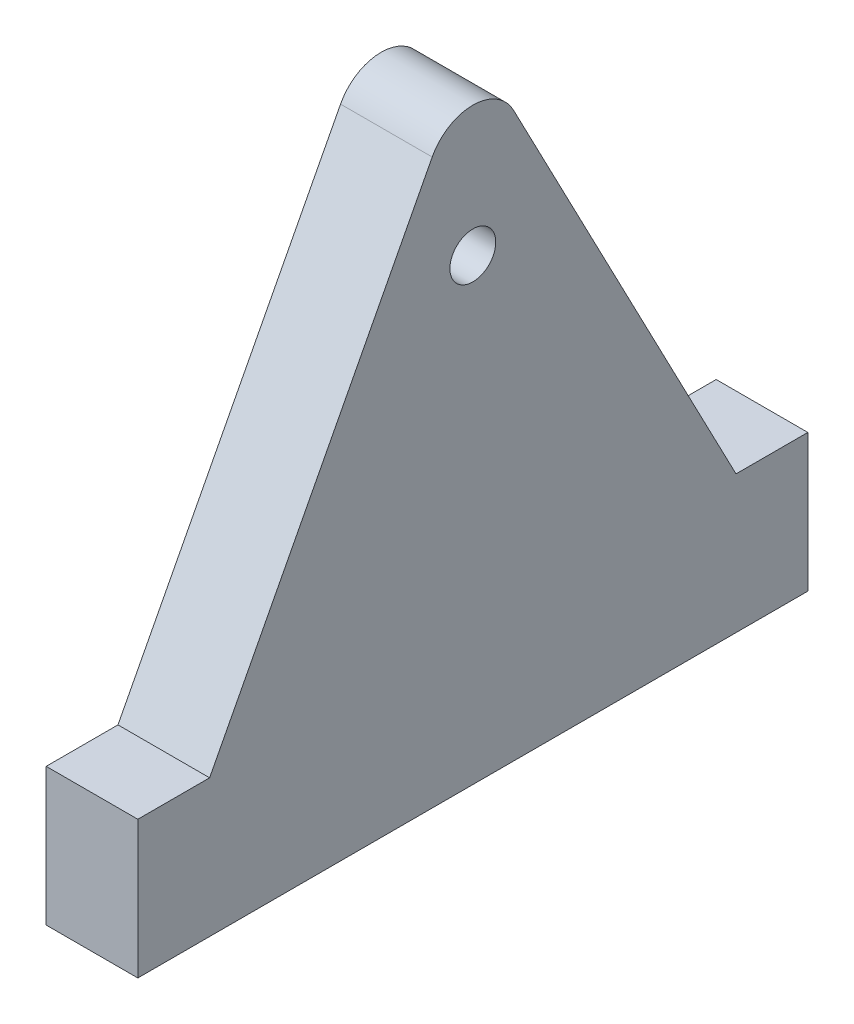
from build123d import *

# Parameters (mm, degrees)
BOSS_EXTRUDE1_DEPTH     = 20
CUT_EXTRUDE2_DEPTH      = 104.167611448
CUT_EXTRUDE2_DEPTH_BACK = 104.167611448
SKETCH2_R               = 5
SKETCH3_W               = 20
SKETCH3_H               = 146.199261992
BOSS_EXTRUDE2_DEPTH     = 30


with BuildPart() as part:
    # Sketch1 → Boss-Extrude1 (new body)
    with BuildSketch(Plane(origin=(0, 0, 0), x_dir=(0, 0, -1), z_dir=(1, 0, 0))):
        with BuildLine():
            Line((-8.864389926, 53.02297053), (-73.099630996, -70))
            Line((-73.099630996, -70), (73.099630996, -70))
            Line((73.099630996, -70), (8.864389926, 53.02297053))
            ThreePointArc((8.864389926, 53.02297053), (0, 58.394516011), (-8.864389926, 53.02297053))
        make_face()
    extrude(amount=BOSS_EXTRUDE1_DEPTH)

    # Sketch2 → Cut-Extrude2 (cut, two sides: drawn at the far end of the back side and taken through both)
    with BuildSketch(Plane(origin=(20, 0, 0), x_dir=(0, 0, -1), z_dir=(1, 0, 0)).offset(-CUT_EXTRUDE2_DEPTH_BACK)):
        with Locations((0, 30)):
            Circle(SKETCH2_R)
    extrude(amount=CUT_EXTRUDE2_DEPTH + CUT_EXTRUDE2_DEPTH_BACK, mode=Mode.SUBTRACT)

    # Sketch3 → Boss-Extrude2 (add)
    with BuildSketch(Plane.XZ.offset(70)):
        with Locations((10, 0)):
            Rectangle(SKETCH3_W, SKETCH3_H)
    extrude(amount=-BOSS_EXTRUDE2_DEPTH)


solid = part.part
